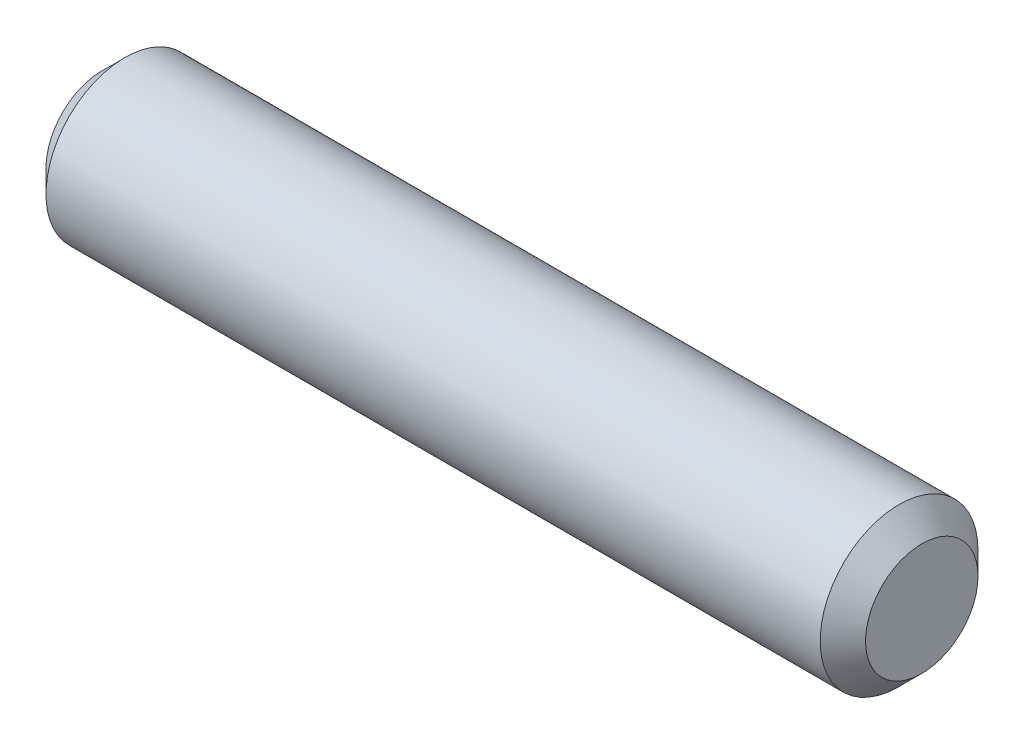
from build123d import *

# Parameters (mm, degrees)
SKETCH1_R           = 3.97383
BOSS_EXTRUDE1_DEPTH = 20.6375
CHAMFER1_SIZE       = 1.143


with BuildPart() as part:
    # Sketch1 → Boss-Extrude1 (new, symmetric)
    with BuildSketch(Plane(origin=(0, 0, 0), x_dir=(0, 0, -1), z_dir=(1, 0, 0))):
        Circle(SKETCH1_R)
    extrude(amount=BOSS_EXTRUDE1_DEPTH, both=True)

    # Chamfer1
    chamfer1_edges = [part.edges().sort_by_distance(p)[0] for p in [
        (-20.6375, 0, 3.97383),
        (20.6375, 0, 3.97383),
    ]]
    chamfer(chamfer1_edges, length=CHAMFER1_SIZE)


solid = part.part
